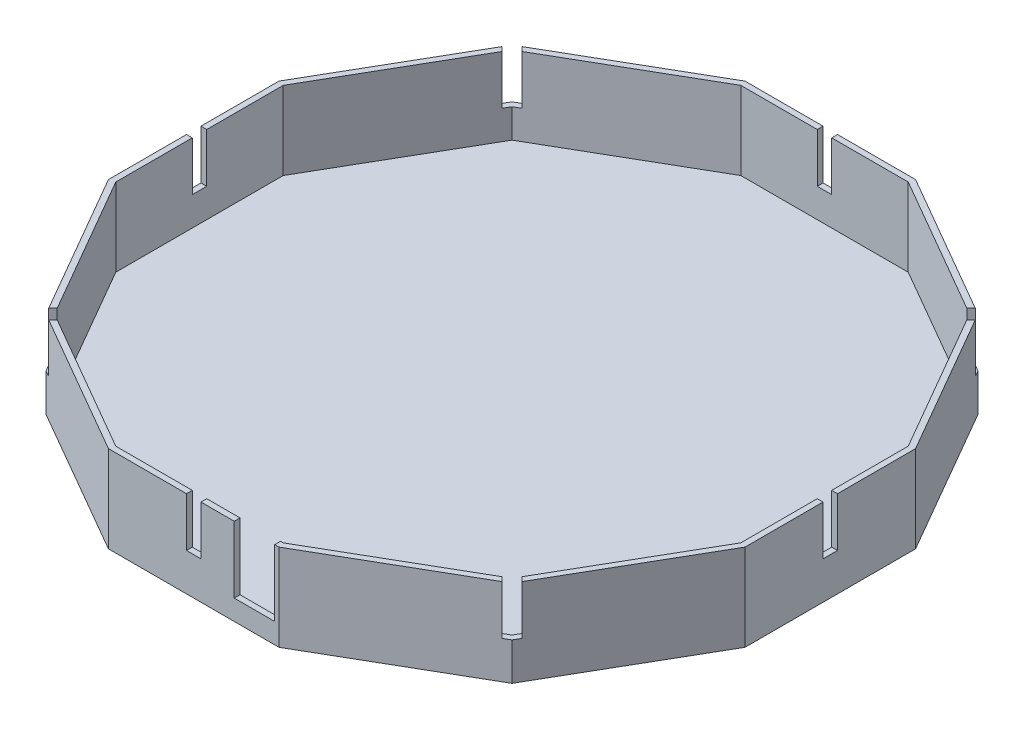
from build123d import *

# Parameters (mm, degrees)
WALLS_OF_ENCLOSURE_DEPTH  = 30
BOTTOM_OF_ENCLOSURE_DEPTH = 3
SKETCH8_W                 = 30
SKETCH8_H                 = 5
WIRE_SLOT_DEPTH           = 17
OTHER_WIRE_SLOTS_COUNT    = 8
SKETCH10_W                = 14
SKETCH10_H                = 10
MICROUSB_SLOT_DEPTH       = 23


with BuildPart() as part:
    # Sketch5 → Walls of Enclosure (new body)
    with BuildSketch(Plane(origin=(0, 0, 0), x_dir=(1, 0, 0), z_dir=(0, 1, 0))):
        Polygon((110, 29.474411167), (80.525588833, 80.525588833), (29.474411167, 110), (-29.474411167, 110), (-80.525588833, 80.525588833), (-110, 29.474411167), (-110, -29.474411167), (-80.525588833, -80.525588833), (-29.474411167, -110), (29.474411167, -110), (80.525588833, -80.525588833), (110, -29.474411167), align=None)
        Polygon((108, -28.938512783), (108, 28.938512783), (79.061487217, 79.061487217), (28.938512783, 108), (-28.938512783, 108), (-79.061487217, 79.061487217), (-108, 28.938512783), (-108, -28.938512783), (-79.061487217, -79.061487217), (-28.938512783, -108), (28.938512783, -108), (79.061487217, -79.061487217), align=None, mode=Mode.SUBTRACT)
    extrude(amount=WALLS_OF_ENCLOSURE_DEPTH)

    # Sketch7 → Bottom of Enclosure (add)
    with BuildSketch(Plane(origin=(0, 0, 0), x_dir=(1, 0, 0), z_dir=(0, 1, 0))):
        Polygon((108, -28.938512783), (108, 28.938512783), (79.061487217, 79.061487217), (28.938512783, 108), (-28.938512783, 108), (-79.061487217, 79.061487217), (-108, 28.938512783), (-108, -28.938512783), (-79.061487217, -79.061487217), (-28.938512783, -108), (28.938512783, -108), (79.061487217, -79.061487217), align=None)
    extrude(amount=BOTTOM_OF_ENCLOSURE_DEPTH)

    # Sketch8 → Wire Slot (cut)
    with BuildSketch(Plane(origin=(0, 30, 0), x_dir=(1, 0, 0), z_dir=(0, 1, 0))):
        with Locations((107.865935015, 0)):
            Rectangle(SKETCH8_W, SKETCH8_H)
    wire_slot = extrude(amount=-WIRE_SLOT_DEPTH, mode=Mode.SUBTRACT)

    # Other Wire Slots: Wire Slot ×8 about axis
    other_wire_slots_axis = Axis((0, 0, 0), (0, 1, 0))
    for i in range(1, OTHER_WIRE_SLOTS_COUNT):
        add(wire_slot.rotate(other_wire_slots_axis, i * 360 / OTHER_WIRE_SLOTS_COUNT), mode=Mode.SUBTRACT)

    # Sketch10 → MicroUSB Slot (cut)
    with BuildSketch(Plane(origin=(0, 30, 0), x_dir=(1, 0, 0), z_dir=(0, 1, 0))):
        with Locations((21, -110)):
            Rectangle(SKETCH10_W, SKETCH10_H)
    extrude(amount=-MICROUSB_SLOT_DEPTH, mode=Mode.SUBTRACT)


solid = part.part
